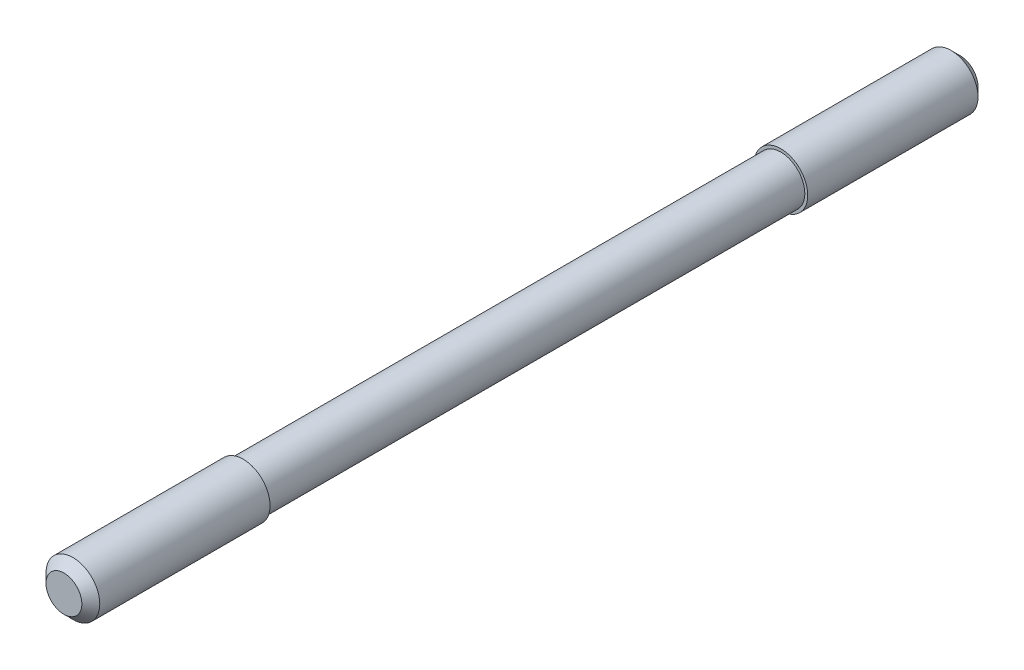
ISO-10303-21;
HEADER;
FILE_DESCRIPTION(('STEP AP214'),'2;1');
FILE_NAME('part.step','',(''),(''),'','','');
FILE_SCHEMA(('AUTOMOTIVE_DESIGN { 1 0 10303 214 1 1 1 1 }'));
ENDSEC;
DATA;
#1=APPLICATION_CONTEXT('core data for automotive mechanical design processes');
#2=APPLICATION_PROTOCOL_DEFINITION('international standard','automotive_design',2000,#1);
#3=PRODUCT_CONTEXT('',#1,'mechanical');
#4=PRODUCT('Part','Part','',(#3));
#5=PRODUCT_RELATED_PRODUCT_CATEGORY('part','',(#4));
#6=PRODUCT_DEFINITION_FORMATION('','',#4);
#7=PRODUCT_DEFINITION_CONTEXT('part definition',#1,'design');
#8=PRODUCT_DEFINITION('design','',#6,#7);
#9=PRODUCT_DEFINITION_SHAPE('','',#8);
#10=(LENGTH_UNIT() NAMED_UNIT(*) SI_UNIT(.MILLI.,.METRE.));
#11=(NAMED_UNIT(*) PLANE_ANGLE_UNIT() SI_UNIT($,.RADIAN.));
#12=(NAMED_UNIT(*) SI_UNIT($,.STERADIAN.) SOLID_ANGLE_UNIT());
#13=UNCERTAINTY_MEASURE_WITH_UNIT(LENGTH_MEASURE(1.E-05),#10,'distance_accuracy_value','');
#14=(GEOMETRIC_REPRESENTATION_CONTEXT(3) GLOBAL_UNCERTAINTY_ASSIGNED_CONTEXT((#13)) GLOBAL_UNIT_ASSIGNED_CONTEXT((#10,
#11,#12)) REPRESENTATION_CONTEXT('',''));
#15=CARTESIAN_POINT('',(0.,0.,0.));
#16=DIRECTION('',(0.,0.,1.));
#17=DIRECTION('',(1.,0.,0.));
#18=AXIS2_PLACEMENT_3D('',#15,#16,#17);
#19=CARTESIAN_POINT('',(0.,0.,0.));
#20=DIRECTION('',(0.,0.,1.));
#21=DIRECTION('',(1.,0.,0.));
#22=AXIS2_PLACEMENT_3D('',#19,#20,#21);
#23=PLANE('',#22);
#24=CARTESIAN_POINT('',(0.,0.,0.));
#25=DIRECTION('',(0.,0.,1.));
#26=DIRECTION('',(1.,0.,0.));
#27=AXIS2_PLACEMENT_3D('',#24,#25,#26);
#28=CIRCLE('',#27,4.);
#29=CARTESIAN_POINT('',(4.,0.,0.));
#30=VERTEX_POINT('',#29);
#31=EDGE_CURVE('E8',#30,#30,#28,.T.);
#32=ORIENTED_EDGE('',*,*,#31,.F.);
#33=EDGE_LOOP('',(#32));
#34=FACE_BOUND('',#33,.T.);
#35=ADVANCED_FACE('F12',(#34),#23,.F.);
#36=CARTESIAN_POINT('',(0.,0.,2.));
#37=DIRECTION('',(0.,0.,1.));
#38=DIRECTION('',(1.,0.,0.));
#39=AXIS2_PLACEMENT_3D('',#36,#37,#38);
#40=CONICAL_SURFACE('',#39,6.,0.785398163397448);
#41=ORIENTED_EDGE('',*,*,#31,.T.);
#42=EDGE_LOOP('',(#41));
#43=FACE_BOUND('',#42,.T.);
#44=CARTESIAN_POINT('',(0.,0.,2.));
#45=DIRECTION('',(0.,0.,1.));
#46=DIRECTION('',(1.,0.,0.));
#47=AXIS2_PLACEMENT_3D('',#44,#45,#46);
#48=CIRCLE('',#47,6.);
#49=CARTESIAN_POINT('',(6.,0.,2.));
#50=VERTEX_POINT('',#49);
#51=EDGE_CURVE('E18',#50,#50,#48,.T.);
#52=ORIENTED_EDGE('',*,*,#51,.F.);
#53=EDGE_LOOP('',(#52));
#54=FACE_BOUND('',#53,.T.);
#55=ADVANCED_FACE('F61',(#43,#54),#40,.T.);
#56=CARTESIAN_POINT('',(0.,0.,70.));
#57=DIRECTION('',(0.,0.,1.));
#58=DIRECTION('',(1.,0.,0.));
#59=AXIS2_PLACEMENT_3D('',#56,#57,#58);
#60=CYLINDRICAL_SURFACE('',#59,6.);
#61=CARTESIAN_POINT('',(0.,0.,40.));
#62=DIRECTION('',(0.,0.,1.));
#63=DIRECTION('',(1.,0.,0.));
#64=AXIS2_PLACEMENT_3D('',#61,#62,#63);
#65=CIRCLE('',#64,6.);
#66=CARTESIAN_POINT('',(6.,0.,40.));
#67=VERTEX_POINT('',#66);
#68=EDGE_CURVE('E22',#67,#67,#65,.T.);
#69=ORIENTED_EDGE('',*,*,#68,.F.);
#70=EDGE_LOOP('',(#69));
#71=FACE_BOUND('',#70,.T.);
#72=ORIENTED_EDGE('',*,*,#51,.T.);
#73=EDGE_LOOP('',(#72));
#74=FACE_BOUND('',#73,.T.);
#75=ADVANCED_FACE('F66',(#71,#74),#60,.T.);
#76=CARTESIAN_POINT('',(6.,0.,40.));
#77=DIRECTION('',(0.,0.,-1.));
#78=DIRECTION('',(-1.,0.,0.));
#79=AXIS2_PLACEMENT_3D('',#76,#77,#78);
#80=PLANE('',#79);
#81=CARTESIAN_POINT('',(0.,0.,40.));
#82=DIRECTION('',(0.,0.,1.));
#83=DIRECTION('',(1.,0.,0.));
#84=AXIS2_PLACEMENT_3D('',#81,#82,#83);
#85=CIRCLE('',#84,5.35);
#86=CARTESIAN_POINT('',(5.35,0.,40.));
#87=VERTEX_POINT('',#86);
#88=EDGE_CURVE('E26',#87,#87,#85,.T.);
#89=ORIENTED_EDGE('',*,*,#88,.F.);
#90=EDGE_LOOP('',(#89));
#91=FACE_BOUND('',#90,.T.);
#92=ORIENTED_EDGE('',*,*,#68,.T.);
#93=EDGE_LOOP('',(#92));
#94=FACE_BOUND('',#93,.T.);
#95=ADVANCED_FACE('F70',(#91,#94),#80,.F.);
#96=CARTESIAN_POINT('',(0.,0.,70.));
#97=DIRECTION('',(0.,0.,1.));
#98=DIRECTION('',(1.,0.,0.));
#99=AXIS2_PLACEMENT_3D('',#96,#97,#98);
#100=CYLINDRICAL_SURFACE('',#99,5.35);
#101=CARTESIAN_POINT('',(0.,0.,160.));
#102=DIRECTION('',(0.,0.,1.));
#103=DIRECTION('',(1.,0.,0.));
#104=AXIS2_PLACEMENT_3D('',#101,#102,#103);
#105=CIRCLE('',#104,5.35);
#106=CARTESIAN_POINT('',(5.35,0.,160.));
#107=VERTEX_POINT('',#106);
#108=EDGE_CURVE('E31',#107,#107,#105,.T.);
#109=ORIENTED_EDGE('',*,*,#108,.F.);
#110=EDGE_LOOP('',(#109));
#111=FACE_BOUND('',#110,.T.);
#112=ORIENTED_EDGE('',*,*,#88,.T.);
#113=EDGE_LOOP('',(#112));
#114=FACE_BOUND('',#113,.T.);
#115=ADVANCED_FACE('F77',(#111,#114),#100,.T.);
#116=CARTESIAN_POINT('',(5.35,0.,160.));
#117=DIRECTION('',(0.,0.,1.));
#118=DIRECTION('',(1.,0.,0.));
#119=AXIS2_PLACEMENT_3D('',#116,#117,#118);
#120=PLANE('',#119);
#121=CARTESIAN_POINT('',(0.,0.,160.));
#122=DIRECTION('',(0.,0.,1.));
#123=DIRECTION('',(1.,0.,0.));
#124=AXIS2_PLACEMENT_3D('',#121,#122,#123);
#125=CIRCLE('',#124,6.);
#126=CARTESIAN_POINT('',(6.,0.,160.));
#127=VERTEX_POINT('',#126);
#128=EDGE_CURVE('E34',#127,#127,#125,.T.);
#129=ORIENTED_EDGE('',*,*,#128,.F.);
#130=EDGE_LOOP('',(#129));
#131=FACE_BOUND('',#130,.T.);
#132=ORIENTED_EDGE('',*,*,#108,.T.);
#133=EDGE_LOOP('',(#132));
#134=FACE_BOUND('',#133,.T.);
#135=ADVANCED_FACE('F57',(#131,#134),#120,.F.);
#136=CARTESIAN_POINT('',(0.,0.,70.));
#137=DIRECTION('',(0.,0.,1.));
#138=DIRECTION('',(1.,0.,0.));
#139=AXIS2_PLACEMENT_3D('',#136,#137,#138);
#140=CYLINDRICAL_SURFACE('',#139,6.);
#141=CARTESIAN_POINT('',(0.,0.,198.));
#142=DIRECTION('',(0.,0.,1.));
#143=DIRECTION('',(1.,0.,0.));
#144=AXIS2_PLACEMENT_3D('',#141,#142,#143);
#145=CIRCLE('',#144,6.);
#146=CARTESIAN_POINT('',(6.,0.,198.));
#147=VERTEX_POINT('',#146);
#148=EDGE_CURVE('E37',#147,#147,#145,.T.);
#149=ORIENTED_EDGE('',*,*,#148,.F.);
#150=EDGE_LOOP('',(#149));
#151=FACE_BOUND('',#150,.T.);
#152=ORIENTED_EDGE('',*,*,#128,.T.);
#153=EDGE_LOOP('',(#152));
#154=FACE_BOUND('',#153,.T.);
#155=ADVANCED_FACE('F48',(#151,#154),#140,.T.);
#156=CARTESIAN_POINT('',(0.,0.,200.));
#157=DIRECTION('',(0.,0.,-1.));
#158=DIRECTION('',(-1.,0.,0.));
#159=AXIS2_PLACEMENT_3D('',#156,#157,#158);
#160=CONICAL_SURFACE('',#159,4.,0.785398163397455);
#161=ORIENTED_EDGE('',*,*,#148,.T.);
#162=EDGE_LOOP('',(#161));
#163=FACE_BOUND('',#162,.T.);
#164=CARTESIAN_POINT('',(0.,0.,200.));
#165=DIRECTION('',(0.,0.,1.));
#166=DIRECTION('',(1.,0.,0.));
#167=AXIS2_PLACEMENT_3D('',#164,#165,#166);
#168=CIRCLE('',#167,4.);
#169=CARTESIAN_POINT('',(4.,0.,200.));
#170=VERTEX_POINT('',#169);
#171=EDGE_CURVE('E40',#170,#170,#168,.T.);
#172=ORIENTED_EDGE('',*,*,#171,.F.);
#173=EDGE_LOOP('',(#172));
#174=FACE_BOUND('',#173,.T.);
#175=ADVANCED_FACE('F46',(#163,#174),#160,.T.);
#176=CARTESIAN_POINT('',(4.,0.,200.));
#177=DIRECTION('',(0.,0.,-1.));
#178=DIRECTION('',(-1.,0.,0.));
#179=AXIS2_PLACEMENT_3D('',#176,#177,#178);
#180=PLANE('',#179);
#181=ORIENTED_EDGE('',*,*,#171,.T.);
#182=EDGE_LOOP('',(#181));
#183=FACE_BOUND('',#182,.T.);
#184=ADVANCED_FACE('F44',(#183),#180,.F.);
#185=CLOSED_SHELL('',(#35,#55,#75,#95,#115,#135,#155,#175,#184));
#186=MANIFOLD_SOLID_BREP('B1',#185);
#187=ADVANCED_BREP_SHAPE_REPRESENTATION('',(#18,#186),#14);
#188=SHAPE_DEFINITION_REPRESENTATION(#9,#187);
ENDSEC;
END-ISO-10303-21;
